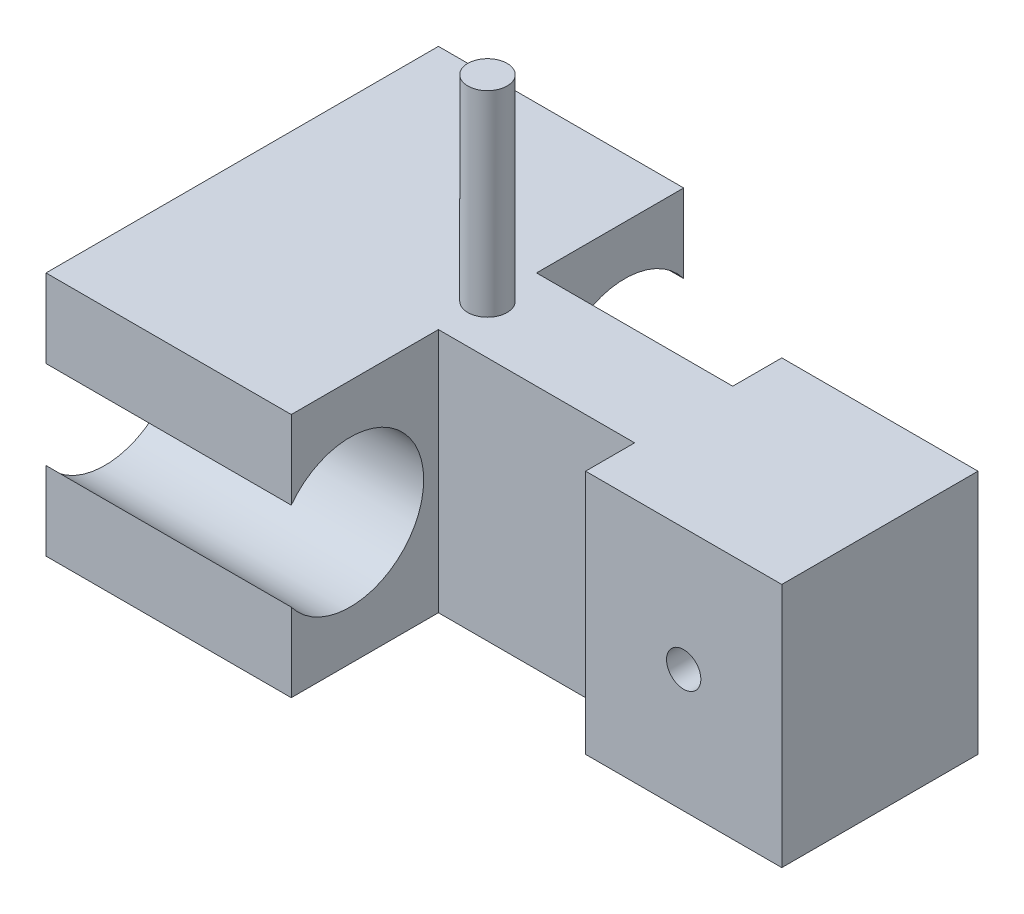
from build123d import *

# Parameters (mm, degrees)
BOSS_EXTRUDE1_DEPTH = 63.5
SKETCH2_R           = 19.05
CUT_EXTRUDE1_DEPTH  = 63.5
SKETCH3_R           = 4.445
CUT_EXTRUDE2_DEPTH  = 50.8
SKETCH4_R           = 5.08
BOSS_EXTRUDE2_DEPTH = 50.8


with BuildPart() as part:
    # Sketch1 → Boss-Extrude1 (new body)
    with BuildSketch(Plane(origin=(0, 0, 0), x_dir=(1, 0, 0), z_dir=(0, 1, 0))):
        Polygon((0, 0), (165.1, 0), (165.1, 25.4), (114.3, 25.4), (114.3, 12.7), (63.5, 12.7), (63.5, 50.8), (0, 50.8), align=None)
    boss_extrude1 = extrude(amount=BOSS_EXTRUDE1_DEPTH)

    # Mirror1: Boss-Extrude1 across plane
    add(boss_extrude1.mirror(Plane(origin=(0, 63.5, 0), x_dir=(1, 0, 0), z_dir=(0, 0, -1))))

    # Sketch2 → Cut-Extrude1 (cut)
    with BuildSketch(Plane.ZY):
        with Locations((-35.56, 31.75)):
            Circle(SKETCH2_R)
        with Locations((35.56, 31.75)):
            Circle(SKETCH2_R)
    extrude(amount=-CUT_EXTRUDE1_DEPTH, mode=Mode.SUBTRACT)

    # Sketch3 → Cut-Extrude2 (cut)
    with BuildSketch(Plane(origin=(0, 0, -25.4), x_dir=(-1, 0, 0), z_dir=(0, 0, -1))):
        with Locations((-139.7, 31.75)):
            Circle(SKETCH3_R)
    extrude(amount=-CUT_EXTRUDE2_DEPTH, mode=Mode.SUBTRACT)

    # Sketch4 → Boss-Extrude2 (add)
    with BuildSketch(Plane(origin=(0, 63.5, 0), x_dir=(1, 0, 0), z_dir=(0, 1, 0))):
        with Locations(Location((63.5, 0, 0), (0, 0, 90))):
            Circle(SKETCH4_R)
    extrude(amount=BOSS_EXTRUDE2_DEPTH)


solid = part.part
